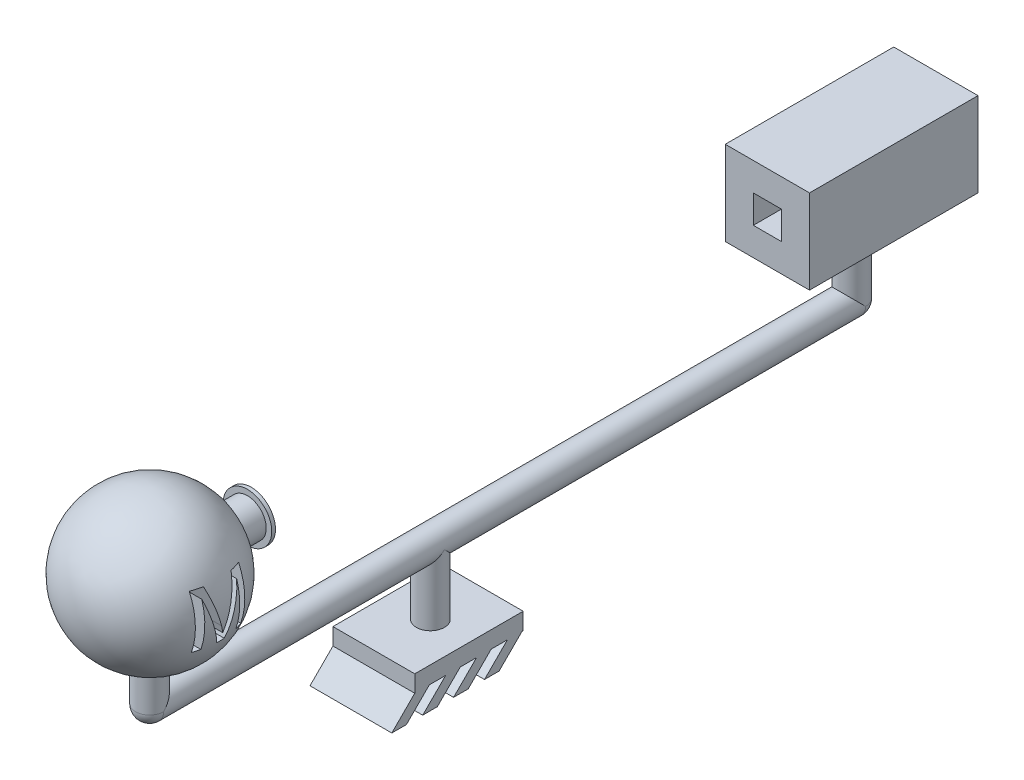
from build123d import *

# Parameters (mm, degrees)
ESQUISSE1_R             = 2.5
BASE_EXTRUSION_DEPTH    = 12
BOSS_EXTRU_1_DEPTH      = 50
BOSS_EXTRU_1_DEPTH_BACK = 75
ESQUISSE2_R             = 2.5
ESQUISSE3_R             = 2.5
BOSS_EXTRU_2_DEPTH      = 20
ESQUISSE4_R             = 2.5
BOSS_EXTRU_3_DEPTH      = 20
BOSS_EXTRU_4_DEPTH      = 7.5
BOSS_EXTRU_4_DEPTH_BACK = 7.5
ESQUISSE5_W             = 30
ESQUISSE5_H             = 15
ESQUISSE8_W             = 5
ESQUISSE8_H             = 5
ENL_V_MAT_EXTRU_2_DEPTH = 52.5
ESQUISSE9_W             = 14.568669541
ESQUISSE9_H             = 19.303487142
BOSS_EXTRU_5_DEPTH      = 3
EXTRUSION1_DEPTH        = 14.568669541
ENL_V_MAT_EXTRU_4_DEPTH = 40.650641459


with BuildPart() as part:
    # Esquisse1 → Base-Extrusion (new body)
    with BuildSketch(Plane(origin=(0, 0, 0), x_dir=(1, 0, 0), z_dir=(0, 1, 0))):
        with Locations(Location((0, 0, 0), (0, 0, 270))):
            Circle(ESQUISSE1_R)
    extrude(amount=-BASE_EXTRUSION_DEPTH)

    # Esquisse2 → Boss.-Extru.1 (add, two sides: drawn at the far end of the back side and taken through both)
    with BuildSketch(Plane.XY.offset(-BOSS_EXTRU_1_DEPTH_BACK)):
        Circle(ESQUISSE2_R)
    extrude(amount=BOSS_EXTRU_1_DEPTH + BOSS_EXTRU_1_DEPTH_BACK)

    # Esquisse3 → Boss.-Extru.2 (add)
    with BuildSketch(Plane(origin=(0, 0, 0), x_dir=(1, 0, 0), z_dir=(0, 1, 0))):
        with Locations(Location((0, 75, 0), (0, 0, 180))):
            Circle(ESQUISSE3_R)
    extrude(amount=BOSS_EXTRU_2_DEPTH)

    # Esquisse4 → Boss.-Extru.3 (add)
    with BuildSketch(Plane(origin=(0, 0, 0), x_dir=(1, 0, 0), z_dir=(0, 1, 0))):
        with Locations((0, -50)):
            Circle(ESQUISSE4_R)
    extrude(amount=BOSS_EXTRU_3_DEPTH)

    # Esquisse5 → Boss.-Extru.4 (add, two sides: drawn at the far end of the back side and taken through both)
    with BuildSketch(Plane(origin=(0, 0, 0), x_dir=(0, 0, -1), z_dir=(1, 0, 0)).offset(-BOSS_EXTRU_4_DEPTH_BACK)):
        with Locations((75, 20)):
            Rectangle(ESQUISSE5_W, ESQUISSE5_H)
    extrude(amount=BOSS_EXTRU_4_DEPTH + BOSS_EXTRU_4_DEPTH_BACK)

    # Esquisse8 → Enl_v. mat.-Extru.2 (cut)
    with BuildSketch(Plane.XY.offset(-60)):
        with Locations((0, 20)):
            Rectangle(ESQUISSE8_W, ESQUISSE8_H)
    extrude(amount=-ENL_V_MAT_EXTRU_2_DEPTH, mode=Mode.SUBTRACT)

    # Esquisse9 → Boss.-Extru.5 (add)
    with BuildSketch(Plane.XZ.offset(12)):
        with Locations((-0.273162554, 0.14159331)):
            Rectangle(ESQUISSE9_W, ESQUISSE9_H)
    extrude(amount=BOSS_EXTRU_5_DEPTH)

    # Esquisse10 → Boss.-R_vol.2 (revolve)
    with BuildSketch(Plane.XY.offset(50)):
        with BuildLine():
            Line((2.5, 0), (-2.5, 0))
            ThreePointArc((-2.5, 0), (0, -2.5), (2.5, 0))
        make_face()
    revolve(axis=Axis((-12.218148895, 0, 50), (1, 0, 0)))

    # Esquisse11 → Boss.-R_vol.3 (revolve)
    with BuildSketch(Plane(origin=(0, 0, -75), x_dir=(-1, 0, 0), z_dir=(0, 0, -1))):
        with BuildLine():
            Line((2.5, 0), (-2.5, 0))
            ThreePointArc((-2.5, 0), (0, -2.5), (2.5, 0))
        make_face()
    revolve(axis=Axis((-11.799220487, 0, -75), (1, 0, 0)))

    # Esquisse12 → Extrusion1 (add)
    with BuildSketch(Plane(origin=(7.011172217, 0, 0), x_dir=(0, 0, -1), z_dir=(1, 0, 0))):
        Polygon((-9.793336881, -15), (-13.879825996, -19.086489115), (-11.277872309, -19.086489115), (-7.191383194, -15), align=None)
        Polygon((-4.293336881, -15), (-8.379825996, -19.086489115), (-5.777872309, -19.086489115), (-1.691383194, -15), align=None)
        Polygon((1.206663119, -15), (-2.879825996, -19.086489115), (-0.277872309, -19.086489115), (3.808616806, -15), align=None)
        Polygon((6.706663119, -15), (2.620174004, -19.086489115), (5.222127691, -19.086489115), (9.308616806, -15), align=None)
    extrude(amount=-EXTRUSION1_DEPTH)

    # Esquisse13 → R_volution1 (revolve)
    with BuildSketch(Plane(origin=(0, 0, 0), x_dir=(0, 0, -1), z_dir=(1, 0, 0))):
        with BuildLine():
            Line((-37.24076019, 23.350343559), (-32.5764028, 23.350343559))
            Line((-32.5764028, 23.350343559), (-32.5764028, 24.332809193))
            Line((-32.5764028, 24.332809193), (-31.911587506, 24.332809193))
            Line((-31.911587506, 24.332809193), (-31.911587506, 20))
            Line((-31.911587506, 20), (-63.026722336, 20))
            ThreePointArc((-63.026722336, 20), (-51.605340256, 33.001352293), (-37.24076019, 23.350343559))
        make_face()
    revolve(axis=Axis((0, 20, 17.589285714), (0, 0, 1)))

    # Esquisse15 → Enl_v. mat.-Extru.4 (cut)
    with BuildSketch(Plane(origin=(0, 0, 0), x_dir=(0, 0, -1), z_dir=(1, 0, 0))):
        with BuildLine():
            Line((-54.222566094, 15.838580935), (-54.222566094, 25.084528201))
            Line((-54.222566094, 25.084528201), (-52.261136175, 25.084528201))
            Line((-52.261136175, 25.084528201), (-50.194133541, 18.5964366))
            add(Edge.make_bspline(
                [(-50.194133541, 18.5964366), (-50.17138609, 18.522937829), (-50.127393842, 18.380795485), (-50.062158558, 18.17552886), (-50.002805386, 17.984779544), (-49.949348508, 17.807940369), (-49.898900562, 17.645889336), (-49.85522059, 17.497296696), (-49.813461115, 17.363813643), (-49.788988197, 17.278980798), (-49.777399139, 17.238808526)],
                knots=[0, 0, 0, 0, 1.300204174, 2.514519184, 3.639827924, 4.676153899, 5.636536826, 6.507959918, 7.293450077, 8, 8, 8, 8], degree=3))
            add(Edge.make_bspline(
                [(-49.777399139, 17.238808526), (-49.76449162, 17.282660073), (-49.737023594, 17.375978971), (-49.692493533, 17.522706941), (-49.645112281, 17.685077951), (-49.588411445, 17.860301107), (-49.529307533, 18.051125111), (-49.467270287, 18.257391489), (-49.39571153, 18.47704092), (-49.348157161, 18.629107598), (-49.323621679, 18.707565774)],
                knots=[0, 0, 0, 0, 0.713638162, 1.518667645, 2.393860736, 3.354087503, 4.393659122, 5.512594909, 6.716633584, 8, 8, 8, 8], degree=3))
            Line((-49.323621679, 18.707565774), (-47.276992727, 25.084528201))
            Line((-47.276992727, 25.084528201), (-45.332232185, 25.084528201))
            Line((-45.332232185, 25.084528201), (-45.332232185, 15.838580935))
            Line((-45.332232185, 15.838580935), (-46.636147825, 15.838580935))
            Line((-46.636147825, 15.838580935), (-46.636147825, 23.662074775))
            Line((-46.636147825, 23.662074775), (-49.103215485, 15.838580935))
            Line((-49.103215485, 15.838580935), (-50.466400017, 15.838580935))
            Line((-50.466400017, 15.838580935), (-52.918650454, 23.662074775))
            Line((-52.918650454, 23.662074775), (-52.918650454, 15.838580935))
            Line((-52.918650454, 15.838580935), (-54.222566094, 15.838580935))
        make_face()
    extrude(amount=ENL_V_MAT_EXTRU_4_DEPTH, mode=Mode.SUBTRACT)


solid = part.part
